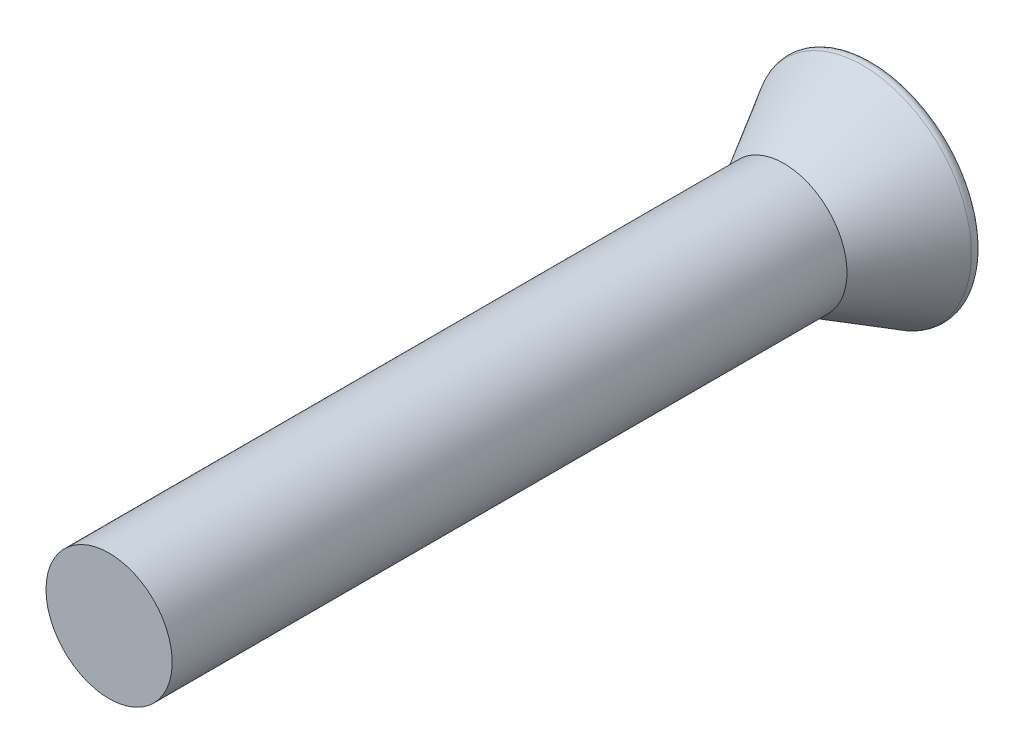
ISO-10303-21;
HEADER;
FILE_DESCRIPTION(('STEP AP214'),'2;1');
FILE_NAME('part.step','',(''),(''),'','','');
FILE_SCHEMA(('AUTOMOTIVE_DESIGN { 1 0 10303 214 1 1 1 1 }'));
ENDSEC;
DATA;
#1=APPLICATION_CONTEXT('core data for automotive mechanical design processes');
#2=APPLICATION_PROTOCOL_DEFINITION('international standard','automotive_design',2000,#1);
#3=PRODUCT_CONTEXT('',#1,'mechanical');
#4=PRODUCT('Part','Part','',(#3));
#5=PRODUCT_RELATED_PRODUCT_CATEGORY('part','',(#4));
#6=PRODUCT_DEFINITION_FORMATION('','',#4);
#7=PRODUCT_DEFINITION_CONTEXT('part definition',#1,'design');
#8=PRODUCT_DEFINITION('design','',#6,#7);
#9=PRODUCT_DEFINITION_SHAPE('','',#8);
#10=(LENGTH_UNIT() NAMED_UNIT(*) SI_UNIT(.MILLI.,.METRE.));
#11=(NAMED_UNIT(*) PLANE_ANGLE_UNIT() SI_UNIT($,.RADIAN.));
#12=(NAMED_UNIT(*) SI_UNIT($,.STERADIAN.) SOLID_ANGLE_UNIT());
#13=UNCERTAINTY_MEASURE_WITH_UNIT(LENGTH_MEASURE(1.E-05),#10,'distance_accuracy_value','');
#14=(GEOMETRIC_REPRESENTATION_CONTEXT(3) GLOBAL_UNCERTAINTY_ASSIGNED_CONTEXT((#13)) GLOBAL_UNIT_ASSIGNED_CONTEXT((#10,
#11,#12)) REPRESENTATION_CONTEXT('',''));
#15=CARTESIAN_POINT('',(0.,0.,0.));
#16=DIRECTION('',(0.,0.,1.));
#17=DIRECTION('',(1.,0.,0.));
#18=AXIS2_PLACEMENT_3D('',#15,#16,#17);
#19=CARTESIAN_POINT('',(0.,0.,0.));
#20=DIRECTION('',(0.,0.,1.));
#21=DIRECTION('',(1.,0.,0.));
#22=AXIS2_PLACEMENT_3D('',#19,#20,#21);
#23=PLANE('',#22);
#24=CARTESIAN_POINT('',(0.,0.,0.));
#25=DIRECTION('',(0.,0.,-1.));
#26=DIRECTION('',(-1.,0.,0.));
#27=AXIS2_PLACEMENT_3D('',#24,#25,#26);
#28=CIRCLE('',#27,1.2874661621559);
#29=CARTESIAN_POINT('',(-1.2874661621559,0.,0.));
#30=VERTEX_POINT('',#29);
#31=EDGE_CURVE('E10',#30,#30,#28,.T.);
#32=ORIENTED_EDGE('',*,*,#31,.T.);
#33=EDGE_LOOP('',(#32));
#34=FACE_BOUND('',#33,.T.);
#35=ADVANCED_FACE('F39',(#34),#23,.F.);
#36=CARTESIAN_POINT('',(0.,0.,0.078739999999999));
#37=DIRECTION('',(0.,0.,-1.));
#38=DIRECTION('',(-1.,0.,0.));
#39=AXIS2_PLACEMENT_3D('',#36,#37,#38);
#40=TOROIDAL_SURFACE('',#39,1.2874661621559,0.0787399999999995);
#41=ORIENTED_EDGE('',*,*,#31,.F.);
#42=EDGE_LOOP('',(#41));
#43=FACE_BOUND('',#42,.T.);
#44=CARTESIAN_POINT('',(0.,0.,0.118109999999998));
#45=DIRECTION('',(0.,0.,-1.));
#46=DIRECTION('',(-1.,0.,0.));
#47=AXIS2_PLACEMENT_3D('',#44,#45,#46);
#48=CIRCLE('',#47,1.35565700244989);
#49=CARTESIAN_POINT('',(-1.35565700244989,0.,0.118109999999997));
#50=VERTEX_POINT('',#49);
#51=EDGE_CURVE('E46',#50,#50,#48,.T.);
#52=ORIENTED_EDGE('',*,*,#51,.T.);
#53=EDGE_LOOP('',(#52));
#54=FACE_BOUND('',#53,.T.);
#55=ADVANCED_FACE('F78',(#43,#54),#40,.T.);
#56=CARTESIAN_POINT('',(0.,0.,1.10236));
#57=DIRECTION('',(0.,0.,-1.));
#58=DIRECTION('',(-1.,0.,0.));
#59=AXIS2_PLACEMENT_3D('',#56,#57,#58);
#60=CONICAL_SURFACE('',#59,0.787399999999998,0.523598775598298);
#61=ORIENTED_EDGE('',*,*,#51,.F.);
#62=EDGE_LOOP('',(#61));
#63=FACE_BOUND('',#62,.T.);
#64=CARTESIAN_POINT('',(0.,0.,1.10236));
#65=DIRECTION('',(0.,0.,-1.));
#66=DIRECTION('',(-1.,0.,0.));
#67=AXIS2_PLACEMENT_3D('',#64,#65,#66);
#68=CIRCLE('',#67,0.787399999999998);
#69=CARTESIAN_POINT('',(-0.787399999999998,0.,1.10236));
#70=VERTEX_POINT('',#69);
#71=EDGE_CURVE('E52',#70,#70,#68,.T.);
#72=ORIENTED_EDGE('',*,*,#71,.T.);
#73=EDGE_LOOP('',(#72));
#74=FACE_BOUND('',#73,.T.);
#75=ADVANCED_FACE('F74',(#63,#74),#60,.T.);
#76=CARTESIAN_POINT('',(0.,0.,-16.5467541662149));
#77=DIRECTION('',(0.,0.,-1.));
#78=DIRECTION('',(-1.,0.,0.));
#79=AXIS2_PLACEMENT_3D('',#76,#77,#78);
#80=CYLINDRICAL_SURFACE('',#79,0.787399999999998);
#81=ORIENTED_EDGE('',*,*,#71,.F.);
#82=EDGE_LOOP('',(#81));
#83=FACE_BOUND('',#82,.T.);
#84=CARTESIAN_POINT('',(0.,0.,9.525));
#85=DIRECTION('',(0.,0.,-1.));
#86=DIRECTION('',(-1.,0.,0.));
#87=AXIS2_PLACEMENT_3D('',#84,#85,#86);
#88=CIRCLE('',#87,0.787399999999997);
#89=CARTESIAN_POINT('',(-0.787399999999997,0.,9.525));
#90=VERTEX_POINT('',#89);
#91=EDGE_CURVE('E58',#90,#90,#88,.T.);
#92=ORIENTED_EDGE('',*,*,#91,.T.);
#93=EDGE_LOOP('',(#92));
#94=FACE_BOUND('',#93,.T.);
#95=ADVANCED_FACE('F66',(#83,#94),#80,.T.);
#96=CARTESIAN_POINT('',(0.,0.,9.525));
#97=DIRECTION('',(0.,0.,-1.));
#98=DIRECTION('',(-1.,0.,0.));
#99=AXIS2_PLACEMENT_3D('',#96,#97,#98);
#100=PLANE('',#99);
#101=ORIENTED_EDGE('',*,*,#91,.F.);
#102=EDGE_LOOP('',(#101));
#103=FACE_BOUND('',#102,.T.);
#104=ADVANCED_FACE('F68',(#103),#100,.F.);
#105=CLOSED_SHELL('',(#35,#55,#75,#95,#104));
#106=MANIFOLD_SOLID_BREP('B2',#105);
#107=ADVANCED_BREP_SHAPE_REPRESENTATION('',(#18,#106),#14);
#108=SHAPE_DEFINITION_REPRESENTATION(#9,#107);
ENDSEC;
END-ISO-10303-21;
